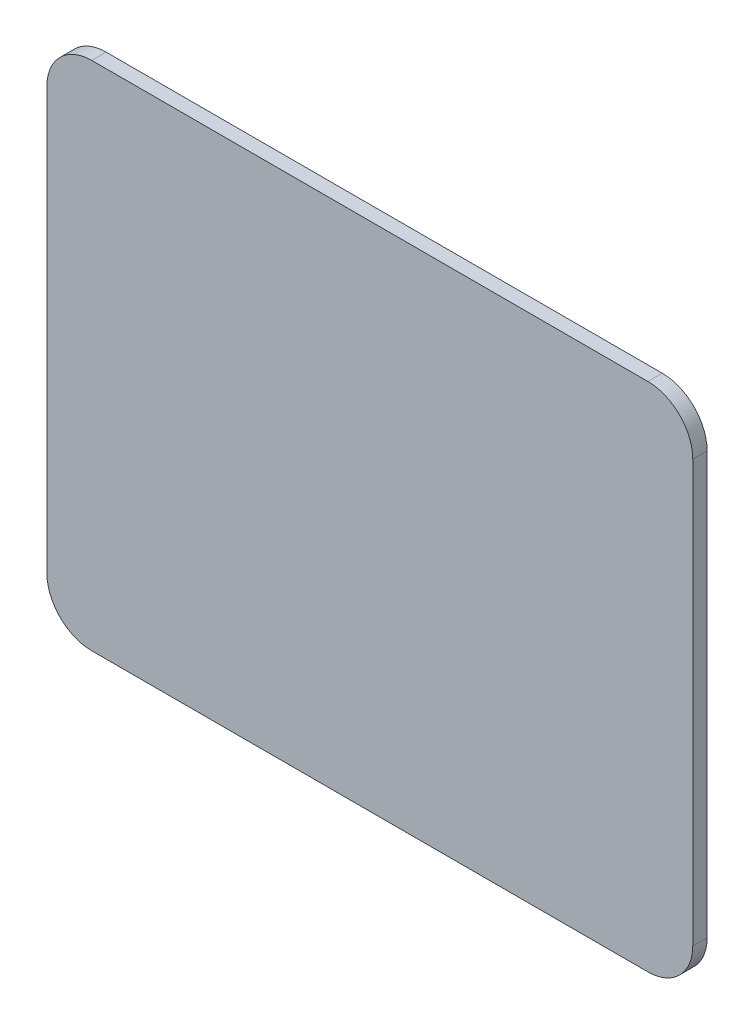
from build123d import *

# Parameters (mm, degrees)
BASE_EXTRUSION_DEPTH = 0.8


with BuildPart() as part:
    # Esquisse1 → Base-Extrusion (new body)
    with BuildSketch(Plane.XY):
        with BuildLine():
            Line((-15.5, 28.5), (15.5, 28.5))
            ThreePointArc((15.5, 28.5), (17.267766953, 27.767766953), (18, 26))
            Line((18, 26), (18, 2.5))
            ThreePointArc((18, 2.5), (17.267766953, 0.732233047), (15.5, 0))
            Line((15.5, 0), (-15.5, 0))
            ThreePointArc((-15.5, 0), (-17.267766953, 0.732233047), (-18, 2.5))
            Line((-18, 2.5), (-18, 26))
            ThreePointArc((-18, 26), (-17.267766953, 27.767766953), (-15.5, 28.5))
        make_face()
    extrude(amount=-BASE_EXTRUSION_DEPTH)


solid = part.part
